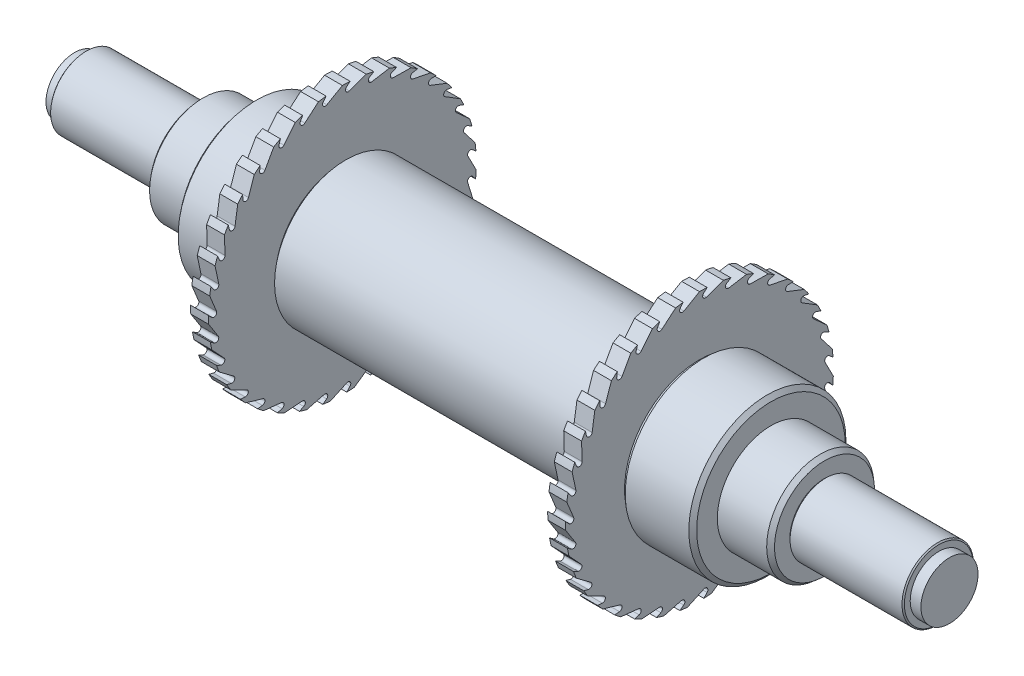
from build123d import *
from OCP.BRepFilletAPI import BRepFilletAPI_MakeChamfer

# Parameters (mm, degrees)
SKETCH2_R           = 37.5
SKETCH2_R_2         = 15
BOSS_EXTRUDE1_DEPTH = 5
CUT_EXTRUDE1_DEPTH  = 183.859235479
CIRPATTERN1_COUNT   = 35
SKETCH5_R           = 22
SKETCH5_R_2         = 15
BOSS_EXTRUDE2_DEPTH = 20
SKETCH6_R           = 10
SKETCH6_R_2         = 8
BOSS_EXTRUDE3_DEPTH = 32
CHAMFER2_SIZE       = 1
CHAMFER2_SIZE2      = 1.191753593
CHAMFER3_SIZE       = 0.3
CHAMFER3_SIZE2      = 0.357526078
CHAMFER1_SIZE       = 1
CHAMFER1_SIZE2      = 1.191753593


with BuildPart() as part:
    # Sketch1 → Revolve1 (revolve)
    with BuildSketch(Plane.XY, mode=Mode.PRIVATE) as revolve1_sk:
        Polygon((-122.5, 8), (-87.5, 8), (-87.5, 15), (-47.5, 15), (-47.5, 20), (47.5, 20), (47.5, 15), (87.5, 15), (87.5, 8), (122.5, 8), (122.5, 0), (-122.5, 0), align=None)
    revolve(revolve1_sk.sketch.rotate(Axis((122.5, 0, 0), (1, 0, 0)), 90), axis=Axis((122.5, 0, 0), (1, 0, 0)))

    # Chamfer1: one chamfer whose edges measure the first distance from different faces: ONE call of the kernel's chamfer builder (chamfer() names one face for all edges)
    chamfer1_edges_1 = [part.edges().sort_by_distance(p)[0] for p in [
        (-47.5, 0, -20),
    ]]
    chamfer1_side_1 = [part.faces().sort_by_distance(p)[0] for p in [
        (0, 0, -20),
    ]]
    chamfer1_edges_2 = [part.edges().sort_by_distance(p)[0] for p in [
        (47.5, 0, -20),
    ]]
    chamfer1_side_2 = [part.faces().sort_by_distance(p)[0] for p in [
        (47.5, 0, -19.434314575),
    ]]
    chamfer1_edges_3 = [part.edges().sort_by_distance(p)[0] for p in [
        (87.5, 0, -15),
    ]]
    chamfer1_side_3 = [part.faces().sort_by_distance(p)[0] for p in [
        (87.5, 0, -14.575735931),
    ]]
    chamfer1_edges_4 = [part.edges().sort_by_distance(p)[0] for p in [
        (-87.5, 0, -15),
    ]]
    chamfer1_side_4 = [part.faces().sort_by_distance(p)[0] for p in [
        (-67.5, 0, -15),
    ]]
    chamfer1 = BRepFilletAPI_MakeChamfer(part.part.solid().wrapped)
    for e in chamfer1_edges_1:
        chamfer1.Add(CHAMFER1_SIZE, CHAMFER1_SIZE2, e.wrapped, chamfer1_side_1[0].wrapped)  # the first distance lies on this face
    for e in chamfer1_edges_2:
        chamfer1.Add(CHAMFER1_SIZE, CHAMFER1_SIZE2, e.wrapped, chamfer1_side_2[0].wrapped)  # the first distance lies on this face
    for e in chamfer1_edges_3:
        chamfer1.Add(CHAMFER1_SIZE, CHAMFER1_SIZE2, e.wrapped, chamfer1_side_3[0].wrapped)  # the first distance lies on this face
    for e in chamfer1_edges_4:
        chamfer1.Add(CHAMFER1_SIZE, CHAMFER1_SIZE2, e.wrapped, chamfer1_side_4[0].wrapped)  # the first distance lies on this face
    add(Compound.cast(chamfer1.Shape()), mode=Mode.REPLACE)


with BuildPart() as body_2:
    # Sketch2 → Boss-Extrude1 (new body)
    with BuildSketch(Plane(origin=(47.5, 0, 0), x_dir=(0, 0, -1), z_dir=(1, 0, 0))):
        Circle(SKETCH2_R)
        Circle(SKETCH2_R_2, mode=Mode.SUBTRACT)
    extrude(amount=BOSS_EXTRUDE1_DEPTH)

    # Sketch3 → Cut-Extrude1 (cut, through all)
    with BuildSketch(Plane(origin=(52.5, 0, 0), x_dir=(0, 0, -1), z_dir=(1, 0, 0))):
        with BuildLine():
            Line((0, 37.5), (-4.363461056, 34.980754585))
            ThreePointArc((-4.363461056, 34.980754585), (-5.36722872, 35.148727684), (-5.393869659, 36.166104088))
            Line((-5.393869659, 36.166104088), (-4.570100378, 37.220480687))
            ThreePointArc((-4.570100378, 37.220480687), (-2.289320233, 37.430054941), (0, 37.5))
        make_face()
    cut_extrude1 = extrude(amount=-CUT_EXTRUDE1_DEPTH, mode=Mode.SUBTRACT)

    # CirPattern1: Cut-Extrude1 ×35 about axis
    cirpattern1_axis = Axis((0, 0, 0), (1, 0, 0))
    for i in range(1, CIRPATTERN1_COUNT):
        add(cut_extrude1.rotate(cirpattern1_axis, i * 360 / CIRPATTERN1_COUNT), mode=Mode.SUBTRACT)


with BuildPart() as body_3:
    # Sketch5 → Boss-Extrude2 (new body)
    with BuildSketch(Plane(origin=(52.5, 0, 0), x_dir=(0, 0, -1), z_dir=(1, 0, 0))):
        Circle(SKETCH5_R)
        Circle(SKETCH5_R_2, mode=Mode.SUBTRACT)
    extrude(amount=BOSS_EXTRUDE2_DEPTH)

    # Chamfer2: one chamfer whose edges measure the first distance from different faces: ONE call of the kernel's chamfer builder (chamfer() names one face for all edges)
    chamfer2_edges_1 = [body_3.edges().sort_by_distance(p)[0] for p in [
        (52.5, 0, 22),
    ]]
    chamfer2_side_1 = [body_3.faces().sort_by_distance(p)[0] for p in [
        (52.5, 0, 21.377746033),
    ]]
    chamfer2_edges_2 = [body_3.edges().sort_by_distance(p)[0] for p in [
        (72.5, 0, 22),
    ]]
    chamfer2_side_2 = [body_3.faces().sort_by_distance(p)[0] for p in [
        (62.5, 0, 22),
    ]]
    chamfer2 = BRepFilletAPI_MakeChamfer(body_3.part.solid().wrapped)
    for e in chamfer2_edges_1:
        chamfer2.Add(CHAMFER2_SIZE, CHAMFER2_SIZE2, e.wrapped, chamfer2_side_1[0].wrapped)  # the first distance lies on this face
    for e in chamfer2_edges_2:
        chamfer2.Add(CHAMFER2_SIZE, CHAMFER2_SIZE2, e.wrapped, chamfer2_side_2[0].wrapped)  # the first distance lies on this face
    add(Compound.cast(chamfer2.Shape()), mode=Mode.REPLACE)


with BuildPart() as body_4:
    # Sketch6 → Boss-Extrude3 (new body)
    with BuildSketch(Plane(origin=(87.5, 0, 0), x_dir=(0, 0, -1), z_dir=(1, 0, 0))):
        Circle(SKETCH6_R)
        Circle(SKETCH6_R_2, mode=Mode.SUBTRACT)
    extrude(amount=BOSS_EXTRUDE3_DEPTH)

    # Chamfer3: one chamfer whose edges measure the first distance from different faces: ONE call of the kernel's chamfer builder (chamfer() names one face for all edges)
    chamfer3_edges_1 = [body_4.edges().sort_by_distance(p)[0] for p in [
        (87.5, 0, 10),
    ]]
    chamfer3_side_1 = [body_4.faces().sort_by_distance(p)[0] for p in [
        (87.5, 0, 9.717157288),
    ]]
    chamfer3_edges_2 = [body_4.edges().sort_by_distance(p)[0] for p in [
        (119.5, 0, 10),
    ]]
    chamfer3_side_2 = [body_4.faces().sort_by_distance(p)[0] for p in [
        (103.5, 0, 10),
    ]]
    chamfer3 = BRepFilletAPI_MakeChamfer(body_4.part.solid().wrapped)
    for e in chamfer3_edges_1:
        chamfer3.Add(CHAMFER3_SIZE, CHAMFER3_SIZE2, e.wrapped, chamfer3_side_1[0].wrapped)  # the first distance lies on this face
    for e in chamfer3_edges_2:
        chamfer3.Add(CHAMFER3_SIZE, CHAMFER3_SIZE2, e.wrapped, chamfer3_side_2[0].wrapped)  # the first distance lies on this face
    add(Compound.cast(chamfer3.Shape()), mode=Mode.REPLACE)


with BuildPart() as body_5:
    # Mirror1: mirrored copy
    add(body_2.part.mirror(Plane(origin=(0, 0, 0), x_dir=(0, 0, 1), z_dir=(1, 0, 0))))


with BuildPart() as body_6:
    # Mirror1 2: mirrored copy
    add(body_3.part.mirror(Plane(origin=(0, 0, 0), x_dir=(0, 0, 1), z_dir=(1, 0, 0))))


with BuildPart() as body_7:
    # Mirror1 3: mirrored copy
    add(body_4.part.mirror(Plane(origin=(0, 0, 0), x_dir=(0, 0, 1), z_dir=(1, 0, 0))))


solid = Compound([part.part, body_2.part, body_3.part, body_4.part, body_5.part, body_6.part, body_7.part])
